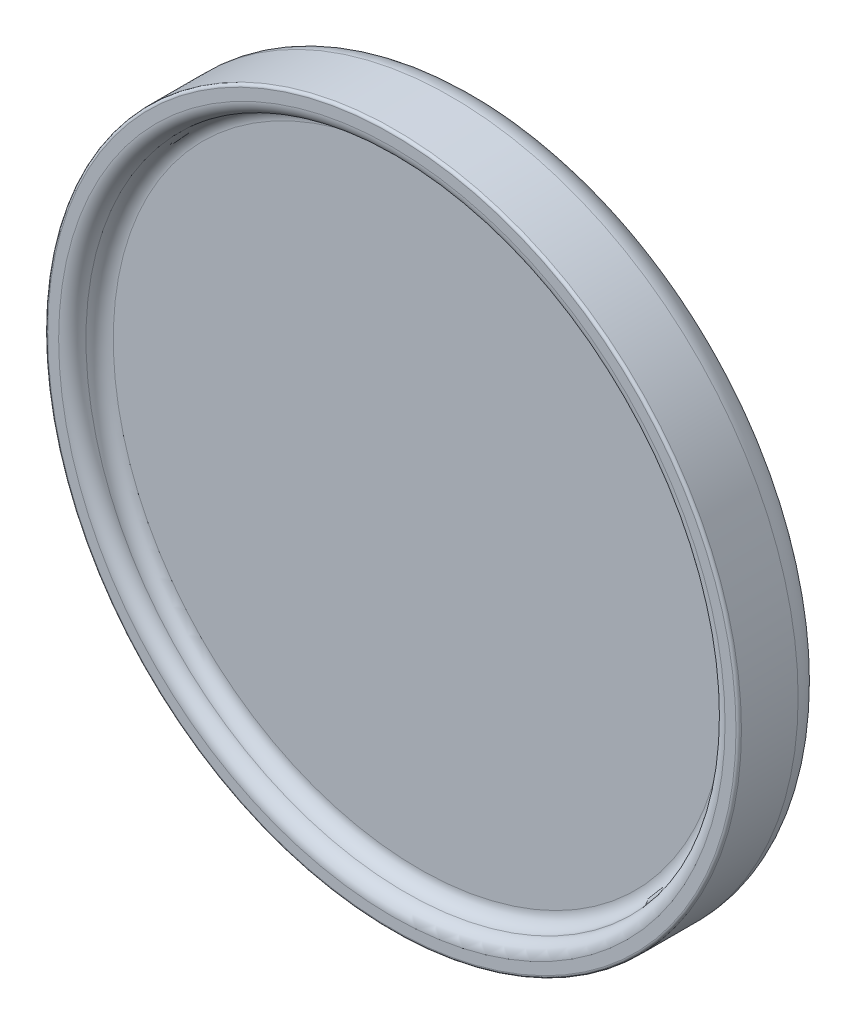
ISO-10303-21;
HEADER;
FILE_DESCRIPTION(('STEP AP214'),'2;1');
FILE_NAME('part.step','',(''),(''),'','','');
FILE_SCHEMA(('AUTOMOTIVE_DESIGN { 1 0 10303 214 1 1 1 1 }'));
ENDSEC;
DATA;
#1=APPLICATION_CONTEXT('core data for automotive mechanical design processes');
#2=APPLICATION_PROTOCOL_DEFINITION('international standard','automotive_design',2000,#1);
#3=PRODUCT_CONTEXT('',#1,'mechanical');
#4=PRODUCT('Part','Part','',(#3));
#5=PRODUCT_RELATED_PRODUCT_CATEGORY('part','',(#4));
#6=PRODUCT_DEFINITION_FORMATION('','',#4);
#7=PRODUCT_DEFINITION_CONTEXT('part definition',#1,'design');
#8=PRODUCT_DEFINITION('design','',#6,#7);
#9=PRODUCT_DEFINITION_SHAPE('','',#8);
#10=(LENGTH_UNIT() NAMED_UNIT(*) SI_UNIT(.MILLI.,.METRE.));
#11=(NAMED_UNIT(*) PLANE_ANGLE_UNIT() SI_UNIT($,.RADIAN.));
#12=(NAMED_UNIT(*) SI_UNIT($,.STERADIAN.) SOLID_ANGLE_UNIT());
#13=UNCERTAINTY_MEASURE_WITH_UNIT(LENGTH_MEASURE(1.E-05),#10,'distance_accuracy_value','');
#14=(GEOMETRIC_REPRESENTATION_CONTEXT(3) GLOBAL_UNCERTAINTY_ASSIGNED_CONTEXT((#13)) GLOBAL_UNIT_ASSIGNED_CONTEXT((#10,
#11,#12)) REPRESENTATION_CONTEXT('',''));
#15=CARTESIAN_POINT('',(0.,0.,0.));
#16=DIRECTION('',(0.,0.,1.));
#17=DIRECTION('',(1.,0.,0.));
#18=AXIS2_PLACEMENT_3D('',#15,#16,#17);
#19=CARTESIAN_POINT('',(0.,0.,-34.1534007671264));
#20=DIRECTION('',(0.,0.,1.));
#21=DIRECTION('',(1.,0.,0.));
#22=AXIS2_PLACEMENT_3D('',#19,#20,#21);
#23=CYLINDRICAL_SURFACE('',#22,152.4);
#24=CARTESIAN_POINT('',(0.,0.,-22.1534007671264));
#25=DIRECTION('',(0.,0.,1.));
#26=DIRECTION('',(1.,0.,0.));
#27=AXIS2_PLACEMENT_3D('',#24,#25,#26);
#28=CIRCLE('',#27,152.4);
#29=CARTESIAN_POINT('',(152.4,0.,-22.1534007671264));
#30=VERTEX_POINT('',#29);
#31=EDGE_CURVE('E775',#30,#30,#28,.T.);
#32=ORIENTED_EDGE('',*,*,#31,.T.);
#33=EDGE_LOOP('',(#32));
#34=FACE_BOUND('',#33,.T.);
#35=CARTESIAN_POINT('',(0.,0.,2.74659923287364));
#36=DIRECTION('',(0.,0.,1.));
#37=DIRECTION('',(1.,0.,0.));
#38=AXIS2_PLACEMENT_3D('',#35,#36,#37);
#39=CIRCLE('',#38,152.4);
#40=CARTESIAN_POINT('',(152.4,0.,2.74659923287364));
#41=VERTEX_POINT('',#40);
#42=EDGE_CURVE('E779',#41,#41,#39,.F.);
#43=ORIENTED_EDGE('',*,*,#42,.T.);
#44=EDGE_LOOP('',(#43));
#45=FACE_BOUND('',#44,.T.);
#46=ADVANCED_FACE('F769',(#34,#45),#23,.T.);
#47=CARTESIAN_POINT('',(0.,0.,-34.1534007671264));
#48=DIRECTION('',(0.,0.,1.));
#49=DIRECTION('',(1.,0.,0.));
#50=AXIS2_PLACEMENT_3D('',#47,#48,#49);
#51=PLANE('',#50);
#52=CARTESIAN_POINT('',(0.,0.,-34.1534007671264));
#53=DIRECTION('',(0.,0.,1.));
#54=DIRECTION('',(1.,0.,0.));
#55=AXIS2_PLACEMENT_3D('',#52,#53,#54);
#56=CIRCLE('',#55,140.4);
#57=CARTESIAN_POINT('',(140.4,0.,-34.1534007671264));
#58=VERTEX_POINT('',#57);
#59=EDGE_CURVE('E11',#58,#58,#56,.F.);
#60=ORIENTED_EDGE('',*,*,#59,.T.);
#61=EDGE_LOOP('',(#60));
#62=FACE_BOUND('',#61,.T.);
#63=ADVANCED_FACE('F817',(#62),#51,.F.);
#64=CARTESIAN_POINT('',(0.,0.,3.94659923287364));
#65=DIRECTION('',(0.,0.,1.));
#66=DIRECTION('',(1.,0.,0.));
#67=AXIS2_PLACEMENT_3D('',#64,#65,#66);
#68=PLANE('',#67);
#69=CARTESIAN_POINT('',(0.,0.,3.94659923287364));
#70=DIRECTION('',(0.,0.,1.));
#71=DIRECTION('',(1.,0.,0.));
#72=AXIS2_PLACEMENT_3D('',#69,#70,#71);
#73=CIRCLE('',#72,151.2);
#74=CARTESIAN_POINT('',(151.2,0.,3.94659923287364));
#75=VERTEX_POINT('',#74);
#76=EDGE_CURVE('E783',#75,#75,#73,.T.);
#77=ORIENTED_EDGE('',*,*,#76,.T.);
#78=EDGE_LOOP('',(#77));
#79=FACE_BOUND('',#78,.T.);
#80=CARTESIAN_POINT('',(0.,0.,3.94659923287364));
#81=DIRECTION('',(0.,0.,1.));
#82=DIRECTION('',(1.,0.,0.));
#83=AXIS2_PLACEMENT_3D('',#80,#81,#82);
#84=CIRCLE('',#83,146.4);
#85=CARTESIAN_POINT('',(146.4,0.,3.94659923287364));
#86=VERTEX_POINT('',#85);
#87=EDGE_CURVE('E791',#86,#86,#84,.F.);
#88=ORIENTED_EDGE('',*,*,#87,.T.);
#89=EDGE_LOOP('',(#88));
#90=FACE_BOUND('',#89,.T.);
#91=ADVANCED_FACE('F812',(#79,#90),#68,.T.);
#92=CARTESIAN_POINT('',(0.,0.,-8.05340076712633));
#93=DIRECTION('',(0.,0.,1.));
#94=DIRECTION('',(1.,0.,0.));
#95=AXIS2_PLACEMENT_3D('',#92,#93,#94);
#96=PLANE('',#95);
#97=CARTESIAN_POINT('',(0.,0.,-8.05340076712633));
#98=DIRECTION('',(0.,0.,1.));
#99=DIRECTION('',(1.,0.,0.));
#100=AXIS2_PLACEMENT_3D('',#97,#98,#99);
#101=CIRCLE('',#100,134.4);
#102=CARTESIAN_POINT('',(134.4,0.,-8.05340076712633));
#103=VERTEX_POINT('',#102);
#104=EDGE_CURVE('E788',#103,#103,#101,.T.);
#105=ORIENTED_EDGE('',*,*,#104,.T.);
#106=EDGE_LOOP('',(#105));
#107=FACE_BOUND('',#106,.T.);
#108=ADVANCED_FACE('F803',(#107),#96,.T.);
#109=CARTESIAN_POINT('',(0.,0.,-2.05340076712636));
#110=DIRECTION('',(0.,0.,1.));
#111=DIRECTION('',(1.,0.,0.));
#112=AXIS2_PLACEMENT_3D('',#109,#110,#111);
#113=TOROIDAL_SURFACE('',#112,146.4,6.);
#114=ORIENTED_EDGE('',*,*,#87,.F.);
#115=EDGE_LOOP('',(#114));
#116=FACE_BOUND('',#115,.T.);
#117=CARTESIAN_POINT('',(0.,0.,-2.05340076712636));
#118=DIRECTION('',(0.,0.,1.));
#119=DIRECTION('',(1.,0.,0.));
#120=AXIS2_PLACEMENT_3D('',#117,#118,#119);
#121=CIRCLE('',#120,140.4);
#122=CARTESIAN_POINT('',(140.4,0.,-2.05340076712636));
#123=VERTEX_POINT('',#122);
#124=EDGE_CURVE('E794',#123,#123,#121,.T.);
#125=ORIENTED_EDGE('',*,*,#124,.F.);
#126=EDGE_LOOP('',(#125));
#127=FACE_BOUND('',#126,.T.);
#128=ADVANCED_FACE('F801',(#116,#127),#113,.T.);
#129=CARTESIAN_POINT('',(0.,0.,-2.05340076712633));
#130=DIRECTION('',(0.,0.,1.));
#131=DIRECTION('',(1.,0.,0.));
#132=AXIS2_PLACEMENT_3D('',#129,#130,#131);
#133=TOROIDAL_SURFACE('',#132,134.4,6.);
#134=ORIENTED_EDGE('',*,*,#124,.T.);
#135=EDGE_LOOP('',(#134));
#136=FACE_BOUND('',#135,.T.);
#137=ORIENTED_EDGE('',*,*,#104,.F.);
#138=EDGE_LOOP('',(#137));
#139=FACE_BOUND('',#138,.T.);
#140=ADVANCED_FACE('F798',(#136,#139),#133,.F.);
#141=CARTESIAN_POINT('',(0.,0.,2.74659923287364));
#142=DIRECTION('',(0.,0.,1.));
#143=DIRECTION('',(1.,0.,0.));
#144=AXIS2_PLACEMENT_3D('',#141,#142,#143);
#145=TOROIDAL_SURFACE('',#144,151.2,1.2);
#146=ORIENTED_EDGE('',*,*,#42,.F.);
#147=EDGE_LOOP('',(#146));
#148=FACE_BOUND('',#147,.T.);
#149=ORIENTED_EDGE('',*,*,#76,.F.);
#150=EDGE_LOOP('',(#149));
#151=FACE_BOUND('',#150,.T.);
#152=ADVANCED_FACE('F810',(#148,#151),#145,.T.);
#153=CARTESIAN_POINT('',(0.,0.,-22.1534007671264));
#154=DIRECTION('',(0.,0.,1.));
#155=DIRECTION('',(1.,0.,0.));
#156=AXIS2_PLACEMENT_3D('',#153,#154,#155);
#157=TOROIDAL_SURFACE('',#156,140.4,12.);
#158=ORIENTED_EDGE('',*,*,#59,.F.);
#159=EDGE_LOOP('',(#158));
#160=FACE_BOUND('',#159,.T.);
#161=ORIENTED_EDGE('',*,*,#31,.F.);
#162=EDGE_LOOP('',(#161));
#163=FACE_BOUND('',#162,.T.);
#164=ADVANCED_FACE('F826',(#160,#163),#157,.T.);
#165=CLOSED_SHELL('',(#46,#63,#91,#108,#128,#140,#152,#164));
#166=MANIFOLD_SOLID_BREP('B2',#165);
#167=ADVANCED_BREP_SHAPE_REPRESENTATION('',(#18,#166),#14);
#168=SHAPE_DEFINITION_REPRESENTATION(#9,#167);
ENDSEC;
END-ISO-10303-21;
